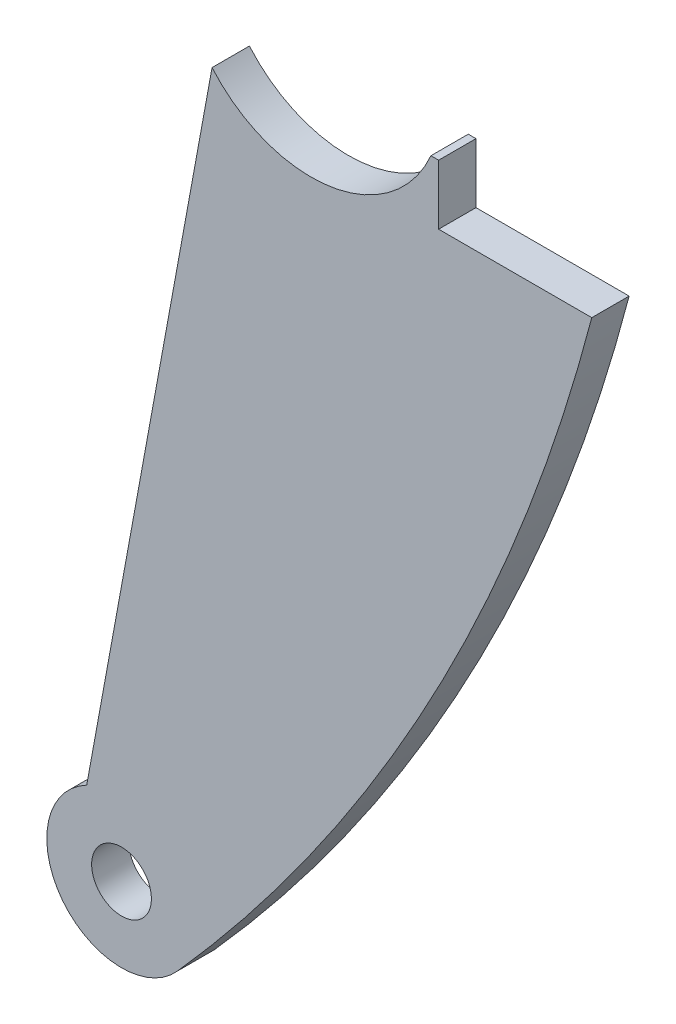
from build123d import *

# Parameters (mm, degrees)
ESQUISSE1_R      = 4
EXTRUSION1_DEPTH = 2.5


with BuildPart() as part:
    # Esquisse1 → Extrusion1 (new, symmetric)
    with BuildSketch(Plane.XY):
        with BuildLine():
            Line((-13.254006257, -11.427218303), (-30.029031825, -102.985173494))
            ThreePointArc((-30.029031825, -102.985173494), (-33.252602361, -117.989520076), (-17.914272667, -118.496930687))
            ThreePointArc((-17.914272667, -118.496930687), (15.99133709, -70.052524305), (37.570735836, -15))
            Line((37.570735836, -15), (17.070735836, -15))
            Line((17.070735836, -15), (17.070735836, -7))
            Line((17.070735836, -7), (16.039014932, -7))
            ThreePointArc((16.039014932, -7), (2.615173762, -17.30349289), (-13.254006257, -11.427218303))
        make_face()
        with Locations((-25.371421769, -111.834279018)):
            Circle(ESQUISSE1_R, mode=Mode.SUBTRACT)
    extrude(amount=EXTRUSION1_DEPTH, both=True)


solid = part.part
